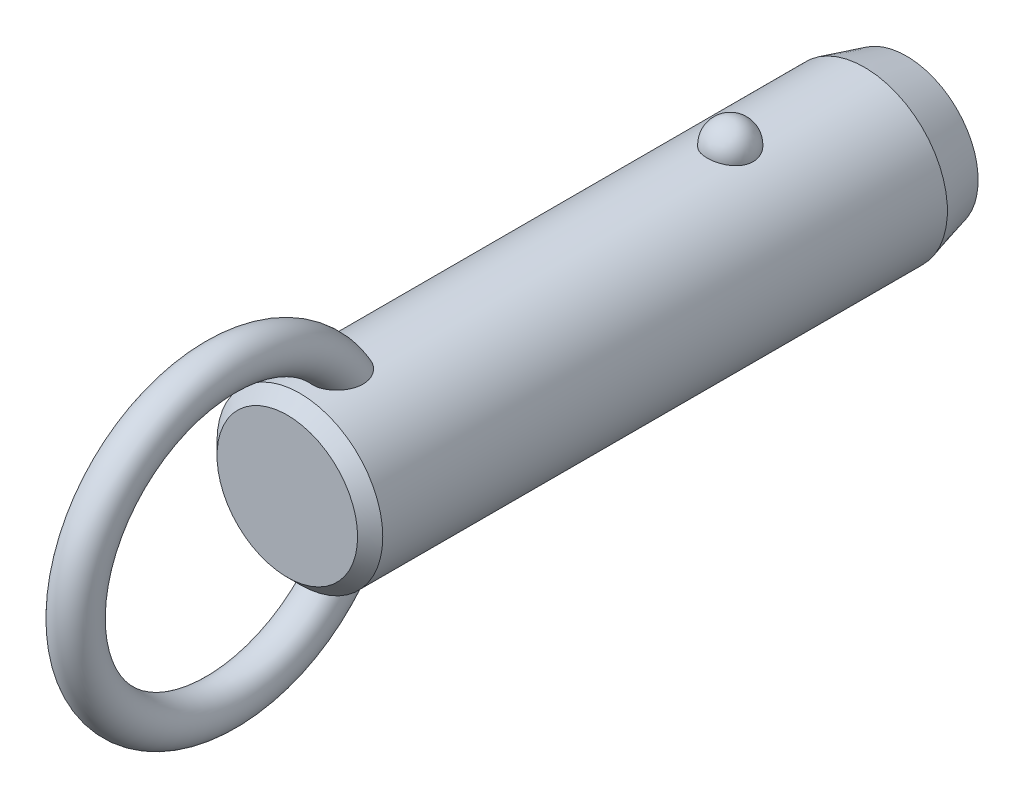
ISO-10303-21;
HEADER;
FILE_DESCRIPTION(('STEP AP214'),'2;1');
FILE_NAME('part.step','',(''),(''),'','','');
FILE_SCHEMA(('AUTOMOTIVE_DESIGN { 1 0 10303 214 1 1 1 1 }'));
ENDSEC;
DATA;
#1=APPLICATION_CONTEXT('core data for automotive mechanical design processes');
#2=APPLICATION_PROTOCOL_DEFINITION('international standard','automotive_design',2000,#1);
#3=PRODUCT_CONTEXT('',#1,'mechanical');
#4=PRODUCT('Part','Part','',(#3));
#5=PRODUCT_RELATED_PRODUCT_CATEGORY('part','',(#4));
#6=PRODUCT_DEFINITION_FORMATION('','',#4);
#7=PRODUCT_DEFINITION_CONTEXT('part definition',#1,'design');
#8=PRODUCT_DEFINITION('design','',#6,#7);
#9=PRODUCT_DEFINITION_SHAPE('','',#8);
#10=(LENGTH_UNIT() NAMED_UNIT(*) SI_UNIT(.MILLI.,.METRE.));
#11=(NAMED_UNIT(*) PLANE_ANGLE_UNIT() SI_UNIT($,.RADIAN.));
#12=(NAMED_UNIT(*) SI_UNIT($,.STERADIAN.) SOLID_ANGLE_UNIT());
#13=UNCERTAINTY_MEASURE_WITH_UNIT(LENGTH_MEASURE(1.E-05),#10,'distance_accuracy_value','');
#14=(GEOMETRIC_REPRESENTATION_CONTEXT(3) GLOBAL_UNCERTAINTY_ASSIGNED_CONTEXT((#13)) GLOBAL_UNIT_ASSIGNED_CONTEXT((#10,
#11,#12)) REPRESENTATION_CONTEXT('',''));
#15=CARTESIAN_POINT('',(0.,0.,0.));
#16=DIRECTION('',(0.,0.,1.));
#17=DIRECTION('',(1.,0.,0.));
#18=AXIS2_PLACEMENT_3D('',#15,#16,#17);
#19=CARTESIAN_POINT('',(0.,0.,30.5));
#20=DIRECTION('',(0.,0.,-1.));
#21=DIRECTION('',(-1.,0.,0.));
#22=AXIS2_PLACEMENT_3D('',#19,#20,#21);
#23=CYLINDRICAL_SURFACE('',#22,7.9);
#24=CARTESIAN_POINT('',(2.1785689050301,7.59367088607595,-2.20000000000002));
#25=CARTESIAN_POINT('',(2.17856679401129,7.59367269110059,-2.07701843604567));
#26=CARTESIAN_POINT('',(2.16853481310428,7.59657145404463,-1.95401006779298));
#27=CARTESIAN_POINT('',(2.12864689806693,7.607843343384,-1.71147811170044));
#28=CARTESIAN_POINT('',(2.09878338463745,7.61621856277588,-1.5919558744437));
#29=CARTESIAN_POINT('',(2.0199931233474,7.63749180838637,-1.35985638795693));
#30=CARTESIAN_POINT('',(1.97107475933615,7.6503878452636,-1.24727610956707));
#31=CARTESIAN_POINT('',(1.85539377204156,7.67926115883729,-1.03213234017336));
#32=CARTESIAN_POINT('',(1.78863158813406,7.69523835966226,-0.929568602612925));
#33=CARTESIAN_POINT('',(1.63856494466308,7.7285848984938,-0.736786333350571));
#34=CARTESIAN_POINT('',(1.55518140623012,7.7459606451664,-0.646630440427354));
#35=CARTESIAN_POINT('',(1.37422937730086,7.78009978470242,-0.481747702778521));
#36=CARTESIAN_POINT('',(1.27666086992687,7.79686317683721,-0.407020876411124));
#37=CARTESIAN_POINT('',(1.07024728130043,7.82786153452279,-0.275278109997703));
#38=CARTESIAN_POINT('',(0.961434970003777,7.84210353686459,-0.218212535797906));
#39=CARTESIAN_POINT('',(0.735351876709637,7.86652194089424,-0.123146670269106));
#40=CARTESIAN_POINT('',(0.618082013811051,7.87669878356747,-0.0851443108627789));
#41=CARTESIAN_POINT('',(0.380637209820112,7.89170521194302,-0.0298158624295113));
#42=CARTESIAN_POINT('',(0.260550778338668,7.89662650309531,-0.0121347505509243));
#43=CARTESIAN_POINT('',(0.019011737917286,7.90090003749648,0.00324379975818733));
#44=CARTESIAN_POINT('',(-0.10244074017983,7.90025280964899,0.000943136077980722));
#45=CARTESIAN_POINT('',(-0.341452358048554,7.89351056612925,-0.0233955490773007));
#46=CARTESIAN_POINT('',(-0.459042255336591,7.88749257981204,-0.0451545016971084));
#47=CARTESIAN_POINT('',(-0.688796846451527,7.87075812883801,-0.107408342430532));
#48=CARTESIAN_POINT('',(-0.800961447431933,7.86004158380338,-0.14790355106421));
#49=CARTESIAN_POINT('',(-1.01743634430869,7.83497131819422,-0.246799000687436));
#50=CARTESIAN_POINT('',(-1.12169791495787,7.82059709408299,-0.305300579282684));
#51=CARTESIAN_POINT('',(-1.31891765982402,7.78976470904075,-0.438549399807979));
#52=CARTESIAN_POINT('',(-1.41187469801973,7.77330633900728,-0.513298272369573));
#53=CARTESIAN_POINT('',(-1.58577142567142,7.73972434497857,-0.678622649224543));
#54=CARTESIAN_POINT('',(-1.66645140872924,7.72259402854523,-0.769470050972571));
#55=CARTESIAN_POINT('',(-1.81161503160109,7.68983776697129,-0.963538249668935));
#56=CARTESIAN_POINT('',(-1.87609753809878,7.6742119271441,-1.0667599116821));
#57=CARTESIAN_POINT('',(-1.98790138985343,7.6460202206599,-1.28401170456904));
#58=CARTESIAN_POINT('',(-2.03501994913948,7.63349104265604,-1.39815107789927));
#59=CARTESIAN_POINT('',(-2.10986724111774,7.6131449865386,-1.6330178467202));
#60=CARTESIAN_POINT('',(-2.1375965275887,7.60532797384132,-1.75374505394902));
#61=CARTESIAN_POINT('',(-2.17289256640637,7.5953195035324,-1.99782562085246));
#62=CARTESIAN_POINT('',(-2.18054294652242,7.59310471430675,-2.12116592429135));
#63=CARTESIAN_POINT('',(-2.17572919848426,7.59448538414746,-2.36741799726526));
#64=CARTESIAN_POINT('',(-2.1632656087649,7.59808068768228,-2.49032977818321));
#65=CARTESIAN_POINT('',(-2.11865035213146,7.61064035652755,-2.73161015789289));
#66=CARTESIAN_POINT('',(-2.08659579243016,7.61957823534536,-2.84999812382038));
#67=CARTESIAN_POINT('',(-2.00367799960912,7.64179982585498,-3.07955956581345));
#68=CARTESIAN_POINT('',(-1.9528140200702,7.65508371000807,-3.19073275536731));
#69=CARTESIAN_POINT('',(-1.83321113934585,7.68460381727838,-3.40337899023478));
#70=CARTESIAN_POINT('',(-1.76437735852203,7.70085556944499,-3.5047965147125));
#71=CARTESIAN_POINT('',(-1.61069526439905,7.73445734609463,-3.69446912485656));
#72=CARTESIAN_POINT('',(-1.52584634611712,7.75180741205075,-3.78272371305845));
#73=CARTESIAN_POINT('',(-1.34198059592,7.78574608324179,-3.94393987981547));
#74=CARTESIAN_POINT('',(-1.24291308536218,7.80233167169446,-4.01684434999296));
#75=CARTESIAN_POINT('',(-1.03352039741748,7.83281625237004,-4.14489386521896));
#76=CARTESIAN_POINT('',(-0.92319600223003,7.84671543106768,-4.20004014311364));
#77=CARTESIAN_POINT('',(-0.695822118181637,7.87011575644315,-4.29042017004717));
#78=CARTESIAN_POINT('',(-0.578872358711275,7.87966903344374,-4.32589112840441));
#79=CARTESIAN_POINT('',(-0.340410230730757,7.8935652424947,-4.37692226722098));
#80=CARTESIAN_POINT('',(-0.218898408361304,7.89790879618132,-4.39248482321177));
#81=CARTESIAN_POINT('',(0.0228107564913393,7.90087453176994,-4.40314405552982));
#82=CARTESIAN_POINT('',(0.142990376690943,7.89960185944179,-4.39861683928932));
#83=CARTESIAN_POINT('',(0.380829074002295,7.89171262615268,-4.37008293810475));
#84=CARTESIAN_POINT('',(0.498488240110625,7.8850962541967,-4.34607694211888));
#85=CARTESIAN_POINT('',(0.727535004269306,7.86726442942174,-4.27939317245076));
#86=CARTESIAN_POINT('',(0.838944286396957,7.85606616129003,-4.23678512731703));
#87=CARTESIAN_POINT('',(1.05295421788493,7.83025654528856,-4.13408348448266));
#88=CARTESIAN_POINT('',(1.15555431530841,7.81564498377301,-4.07398879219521));
#89=CARTESIAN_POINT('',(1.35076763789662,7.7843022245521,-3.93687432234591));
#90=CARTESIAN_POINT('',(1.4432046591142,7.76754209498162,-3.85961036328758));
#91=CARTESIAN_POINT('',(1.6139111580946,7.73387857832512,-3.69076949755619));
#92=CARTESIAN_POINT('',(1.6921781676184,7.71697516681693,-3.59919010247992));
#93=CARTESIAN_POINT('',(1.83380875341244,7.6845643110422,-3.40247278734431));
#94=CARTESIAN_POINT('',(1.89689280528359,7.66908588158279,-3.29712873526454));
#95=CARTESIAN_POINT('',(2.0047823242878,7.64159441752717,-3.07707931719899));
#96=CARTESIAN_POINT('',(2.0495945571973,7.62958010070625,-2.96237743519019));
#97=CARTESIAN_POINT('',(2.11580183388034,7.61146617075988,-2.74040519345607));
#98=CARTESIAN_POINT('',(2.13929812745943,7.60484503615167,-2.63379846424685));
#99=CARTESIAN_POINT('',(2.17068242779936,7.59594664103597,-2.4181348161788));
#100=CARTESIAN_POINT('',(2.17857077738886,7.59366928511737,-2.30907795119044));
#101=CARTESIAN_POINT('',(2.1785689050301,7.59367088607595,-2.20000000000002));
#102=B_SPLINE_CURVE_WITH_KNOTS('',3,(#24,#25,#26,#27,#28,#29,#30,#31,#32,#33,#34,#35,#36,#37,
#38,#39,#40,#41,#42,#43,#44,#45,#46,#47,#48,#49,#50,#51,#52,#53,#54,#55,#56,#57,#58,#59,#60,#61,
#62,#63,#64,#65,#66,#67,#68,#69,#70,#71,#72,#73,#74,#75,#76,#77,#78,#79,#80,#81,#82,#83,#84,#85,
#86,#87,#88,#89,#90,#91,#92,#93,#94,#95,#96,#97,#98,#99,#100,#101),.UNSPECIFIED.,.T.,.F.,(4,2,2,
2,2,2,2,2,2,2,2,2,2,2,2,2,2,2,2,2,2,2,2,2,2,2,2,2,2,2,2,2,2,2,2,2,2,2,4),(0.,0.368552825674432,
0.737246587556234,1.10577831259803,1.4743009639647,1.84462067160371,2.21494081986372,
2.5842105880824,2.95344028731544,3.31611630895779,3.67875788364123,4.03628044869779,
4.39380913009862,4.75338791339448,5.11300280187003,5.47939989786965,5.8458226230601,
6.21639834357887,6.58696347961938,6.95598276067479,7.32499216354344,7.69218715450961,
8.0593967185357,8.42858578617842,8.79778880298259,9.16834203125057,9.5388695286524,
9.90482699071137,10.2707407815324,10.6298333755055,10.9889132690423,11.3466585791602,
11.7044262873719,12.0676511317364,12.4309391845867,12.8004764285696,13.1698767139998,
13.4967701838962,13.8236564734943),.UNSPECIFIED.);
#103=CARTESIAN_POINT('',(2.1785689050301,7.59367088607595,-2.20000000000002));
#104=VERTEX_POINT('',#103);
#105=EDGE_CURVE('E41',#104,#104,#102,.T.);
#106=ORIENTED_EDGE('',*,*,#105,.T.);
#107=EDGE_LOOP('',(#106));
#108=FACE_BOUND('',#107,.T.);
#109=CARTESIAN_POINT('',(0.,0.,38.82));
#110=DIRECTION('',(0.,0.,1.));
#111=DIRECTION('',(1.,0.,0.));
#112=AXIS2_PLACEMENT_3D('',#109,#110,#111);
#113=CIRCLE('',#112,7.9);
#114=CARTESIAN_POINT('',(7.9,0.,38.82));
#115=VERTEX_POINT('',#114);
#116=EDGE_CURVE('E10',#115,#115,#113,.F.);
#117=ORIENTED_EDGE('',*,*,#116,.T.);
#118=EDGE_LOOP('',(#117));
#119=FACE_BOUND('',#118,.T.);
#120=CARTESIAN_POINT('',(-0.63096985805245,-7.87476203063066,32.7124322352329));
#121=CARTESIAN_POINT('',(-0.734180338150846,-7.86648998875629,32.747285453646));
#122=CARTESIAN_POINT('',(-0.834476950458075,-7.85639291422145,32.7908160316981));
#123=CARTESIAN_POINT('',(-1.0262035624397,-7.83366343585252,32.8940948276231));
#124=CARTESIAN_POINT('',(-1.1176141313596,-7.82102565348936,32.9538775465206));
#125=CARTESIAN_POINT('',(-1.28877277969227,-7.79464922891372,33.0878390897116));
#126=CARTESIAN_POINT('',(-1.36854014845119,-7.78091246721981,33.161993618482));
#127=CARTESIAN_POINT('',(-1.51461521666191,-7.75380398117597,33.3224941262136));
#128=CARTESIAN_POINT('',(-1.58092966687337,-7.74043207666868,33.4088339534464));
#129=CARTESIAN_POINT('',(-1.70019064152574,-7.7151252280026,33.5929784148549));
#130=CARTESIAN_POINT('',(-1.75284037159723,-7.70322473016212,33.6909792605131));
#131=CARTESIAN_POINT('',(-1.84263464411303,-7.68224112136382,33.8941029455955));
#132=CARTESIAN_POINT('',(-1.87977299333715,-7.6731591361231,33.9992286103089));
#133=CARTESIAN_POINT('',(-1.94152728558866,-7.65777930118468,34.2232849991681));
#134=CARTESIAN_POINT('',(-1.96475471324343,-7.65179654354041,34.3426167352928));
#135=CARTESIAN_POINT('',(-1.99449499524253,-7.64409642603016,34.5834298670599));
#136=CARTESIAN_POINT('',(-2.0010005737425,-7.64238092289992,34.7049121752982));
#137=CARTESIAN_POINT('',(-1.99856014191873,-7.64302120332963,34.9683409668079));
#138=CARTESIAN_POINT('',(-1.98680021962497,-7.64611845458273,35.1102565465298));
#139=CARTESIAN_POINT('',(-1.9445777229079,-7.65696186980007,35.3911188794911));
#140=CARTESIAN_POINT('',(-1.91409393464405,-7.66471330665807,35.5300620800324));
#141=CARTESIAN_POINT('',(-1.82768670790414,-7.68582947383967,35.831939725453));
#142=CARTESIAN_POINT('',(-1.76772963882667,-7.70003779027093,35.993686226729));
#143=CARTESIAN_POINT('',(-1.65998501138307,-7.72371550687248,36.2276956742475));
#144=CARTESIAN_POINT('',(-1.621079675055,-7.73200670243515,36.3042974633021));
#145=CARTESIAN_POINT('',(-1.53727726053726,-7.74910377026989,36.4540798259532));
#146=CARTESIAN_POINT('',(-1.49238215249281,-7.75790947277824,36.5272615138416));
#147=CARTESIAN_POINT('',(-1.37397050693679,-7.77993338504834,36.7028838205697));
#148=CARTESIAN_POINT('',(-1.29690364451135,-7.79328473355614,36.8029557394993));
#149=CARTESIAN_POINT('',(-1.12885487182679,-7.81939266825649,36.9907147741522));
#150=CARTESIAN_POINT('',(-1.03789926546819,-7.83215032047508,37.0784247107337));
#151=CARTESIAN_POINT('',(-0.869532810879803,-7.85231710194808,37.2134148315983));
#152=CARTESIAN_POINT('',(-0.79571640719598,-7.86021093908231,37.265076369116));
#153=CARTESIAN_POINT('',(-0.640813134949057,-7.87434920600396,37.3563815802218));
#154=CARTESIAN_POINT('',(-0.559737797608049,-7.88059619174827,37.3960438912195));
#155=CARTESIAN_POINT('',(-0.40645605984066,-7.88984116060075,37.4543008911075));
#156=CARTESIAN_POINT('',(-0.335227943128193,-7.89321892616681,37.4753848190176));
#157=CARTESIAN_POINT('',(-0.190193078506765,-7.89804235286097,37.5054141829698));
#158=CARTESIAN_POINT('',(-0.116388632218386,-7.89948969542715,37.5143701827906));
#159=CARTESIAN_POINT('',(0.0318414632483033,-7.90028409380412,37.5192915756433));
#160=CARTESIAN_POINT('',(0.10626813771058,-7.89962640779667,37.5152276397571));
#161=CARTESIAN_POINT('',(0.253290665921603,-7.8962818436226,37.4944615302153));
#162=CARTESIAN_POINT('',(0.32588518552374,-7.8935935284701,37.4777504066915));
#163=CARTESIAN_POINT('',(0.481441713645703,-7.88577340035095,37.4287380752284));
#164=CARTESIAN_POINT('',(0.563611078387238,-7.88026321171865,37.394005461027));
#165=CARTESIAN_POINT('',(0.721129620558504,-7.86741729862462,37.3117965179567));
#166=CARTESIAN_POINT('',(0.796466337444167,-7.86007832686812,37.2642975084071));
#167=CARTESIAN_POINT('',(0.971456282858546,-7.84073285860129,37.136513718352));
#168=CARTESIAN_POINT('',(1.06719686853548,-7.82809461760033,37.0510047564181));
#169=CARTESIAN_POINT('',(1.24418921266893,-7.80192439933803,36.866232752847));
#170=CARTESIAN_POINT('',(1.32540832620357,-7.78839049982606,36.7669395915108));
#171=CARTESIAN_POINT('',(1.45199971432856,-7.76559693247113,36.5895760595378));
#172=CARTESIAN_POINT('',(1.50085649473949,-7.75626094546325,36.5139542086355));
#173=CARTESIAN_POINT('',(1.59197749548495,-7.7380727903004,36.3587428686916));
#174=CARTESIAN_POINT('',(1.63423919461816,-7.72922080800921,36.2791518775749));
#175=CARTESIAN_POINT('',(1.71222612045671,-7.71231959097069,36.1166640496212));
#176=CARTESIAN_POINT('',(1.74794516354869,-7.70427111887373,36.033764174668));
#177=CARTESIAN_POINT('',(1.81270113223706,-7.68929240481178,35.8652967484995));
#178=CARTESIAN_POINT('',(1.84173789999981,-7.68236218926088,35.7797291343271));
#179=CARTESIAN_POINT('',(1.89322698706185,-7.6698375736,35.6052870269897));
#180=CARTESIAN_POINT('',(1.91558744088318,-7.66426199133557,35.5163838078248));
#181=CARTESIAN_POINT('',(1.95281367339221,-7.65485915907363,35.3369696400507));
#182=CARTESIAN_POINT('',(1.96767946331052,-7.65103190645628,35.2464586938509));
#183=CARTESIAN_POINT('',(2.0002145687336,-7.64262981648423,34.9737320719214));
#184=CARTESIAN_POINT('',(2.00600691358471,-7.6410871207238,34.7897099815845));
#185=CARTESIAN_POINT('',(1.98445334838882,-7.64669564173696,34.4765019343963));
#186=CARTESIAN_POINT('',(1.96607186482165,-7.65149688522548,34.346618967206));
#187=CARTESIAN_POINT('',(1.90884967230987,-7.66597624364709,34.0916321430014));
#188=CARTESIAN_POINT('',(1.87002101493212,-7.67565148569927,33.966525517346));
#189=CARTESIAN_POINT('',(1.77063986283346,-7.69918471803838,33.7245401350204));
#190=CARTESIAN_POINT('',(1.70993724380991,-7.71307150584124,33.6077250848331));
#191=CARTESIAN_POINT('',(1.56733070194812,-7.74330306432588,33.3881444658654));
#192=CARTESIAN_POINT('',(1.48543692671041,-7.75964665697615,33.2853722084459));
#193=CARTESIAN_POINT('',(1.31346177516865,-7.79047523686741,33.1093800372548));
#194=CARTESIAN_POINT('',(1.22547278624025,-7.80495298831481,33.0341066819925));
#195=CARTESIAN_POINT('',(1.03724352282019,-7.83218597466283,32.9004864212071));
#196=CARTESIAN_POINT('',(0.937008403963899,-7.84494192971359,32.8421324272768));
#197=CARTESIAN_POINT('',(0.73359933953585,-7.86649045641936,32.7470270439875));
#198=CARTESIAN_POINT('',(0.630941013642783,-7.87547134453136,32.7092109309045));
#199=CARTESIAN_POINT('',(0.420465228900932,-7.88950708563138,32.6511160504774));
#200=CARTESIAN_POINT('',(0.312645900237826,-7.89456050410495,32.6308436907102));
#201=CARTESIAN_POINT('',(0.0960869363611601,-7.9001518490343,32.6084559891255));
#202=CARTESIAN_POINT('',(-0.0126341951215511,-7.90073226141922,32.6061698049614));
#203=CARTESIAN_POINT('',(-0.228766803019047,-7.89742350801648,32.6193678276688));
#204=CARTESIAN_POINT('',(-0.336180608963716,-7.89354403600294,32.6348134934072));
#205=CARTESIAN_POINT('',(-0.473410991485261,-7.88586871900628,32.6662177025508));
#206=CARTESIAN_POINT('',(-0.5052577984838,-7.88388984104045,32.6743541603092));
#207=CARTESIAN_POINT('',(-0.568481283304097,-7.87958326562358,32.6922083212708));
#208=CARTESIAN_POINT('',(-0.599857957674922,-7.87725556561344,32.7019260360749));
#209=CARTESIAN_POINT('',(-0.63096985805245,-7.87476203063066,32.7124322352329));
#210=B_SPLINE_CURVE_WITH_KNOTS('',3,(#120,#121,#122,#123,#124,#125,#126,#127,#128,#129,#130,
#131,#132,#133,#134,#135,#136,#137,#138,#139,#140,#141,#142,#143,#144,#145,#146,#147,#148,#149,
#150,#151,#152,#153,#154,#155,#156,#157,#158,#159,#160,#161,#162,#163,#164,#165,#166,#167,#168,
#169,#170,#171,#172,#173,#174,#175,#176,#177,#178,#179,#180,#181,#182,#183,#184,#185,#186,#187,
#188,#189,#190,#191,#192,#193,#194,#195,#196,#197,#198,#199,#200,#201,#202,#203,#204,#205,#206,
#207,#208,#209),.UNSPECIFIED.,.T.,.F.,(4,2,2,2,2,2,2,2,2,2,2,2,2,2,2,2,2,2,2,2,2,2,2,2,2,2,2,2,
2,2,2,2,2,2,2,2,2,2,2,2,2,2,2,2,4),(0.,0.327622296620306,0.65594559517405,0.983718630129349,
1.3113267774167,1.64554655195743,1.97989964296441,2.34365728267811,2.70757317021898,
3.13333684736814,3.55958380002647,4.07655306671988,4.3352789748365,4.593919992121,
4.9738243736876,5.35301797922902,5.62348245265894,5.89352465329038,6.11565959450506,
6.33760092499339,6.56004255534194,6.78264174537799,7.04930844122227,7.31645206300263,
7.70130871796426,8.08701995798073,8.35824509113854,8.62957365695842,8.90115735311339,
9.17274746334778,9.447918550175,9.7230892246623,10.2715298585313,10.6638393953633,
11.0559179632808,11.4507403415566,11.8453740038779,12.1936425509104,12.5417649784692,
12.8695063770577,13.1973674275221,13.5221104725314,13.8461490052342,13.9449071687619,
14.0436660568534),.UNSPECIFIED.);
#211=CARTESIAN_POINT('',(-0.63096985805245,-7.87476203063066,32.7124322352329));
#212=VERTEX_POINT('',#211);
#213=EDGE_CURVE('E59',#212,#212,#210,.T.);
#214=ORIENTED_EDGE('',*,*,#213,.T.);
#215=EDGE_LOOP('',(#214));
#216=FACE_BOUND('',#215,.T.);
#217=CARTESIAN_POINT('',(-0.63096985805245,7.87476203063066,32.7124322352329));
#218=CARTESIAN_POINT('',(-0.528918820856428,7.88293636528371,32.6779798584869));
#219=CARTESIAN_POINT('',(-0.423745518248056,7.88934810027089,32.651915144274));
#220=CARTESIAN_POINT('',(-0.210236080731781,7.8979273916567,32.6172825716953));
#221=CARTESIAN_POINT('',(-0.10189380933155,7.90008607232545,32.6087513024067));
#222=CARTESIAN_POINT('',(0.11466056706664,7.89990877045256,32.6094570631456));
#223=CARTESIAN_POINT('',(0.222872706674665,7.89757640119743,32.6186798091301));
#224=CARTESIAN_POINT('',(0.436107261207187,7.88867538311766,32.6546525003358));
#225=CARTESIAN_POINT('',(0.541131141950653,7.8821087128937,32.6813942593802));
#226=CARTESIAN_POINT('',(0.745085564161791,7.86545130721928,32.7517561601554));
#227=CARTESIAN_POINT('',(0.844015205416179,7.85536005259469,32.7953787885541));
#228=CARTESIAN_POINT('',(1.03299167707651,7.83275153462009,32.8983796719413));
#229=CARTESIAN_POINT('',(1.12303841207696,7.8202342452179,32.9577580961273));
#230=CARTESIAN_POINT('',(1.29214734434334,7.79408219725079,33.0908647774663));
#231=CARTESIAN_POINT('',(1.37116907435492,7.78044359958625,33.1646436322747));
#232=CARTESIAN_POINT('',(1.51597677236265,7.75353170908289,33.3242353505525));
#233=CARTESIAN_POINT('',(1.58176261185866,7.74025841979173,33.4100483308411));
#234=CARTESIAN_POINT('',(1.70057386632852,7.71504069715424,33.593644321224));
#235=CARTESIAN_POINT('',(1.75320073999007,7.7031425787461,33.6916906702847));
#236=CARTESIAN_POINT('',(1.84293767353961,7.68216822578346,33.8948931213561));
#237=CARTESIAN_POINT('',(1.88004278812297,7.67309289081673,34.0000514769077));
#238=CARTESIAN_POINT('',(1.9417232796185,7.6577294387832,34.2241671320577));
#239=CARTESIAN_POINT('',(1.96491037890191,7.65175648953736,34.3435248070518));
#240=CARTESIAN_POINT('',(1.9945689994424,7.64407702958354,34.5843848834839));
#241=CARTESIAN_POINT('',(2.00103304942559,7.64237242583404,34.7058882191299));
#242=CARTESIAN_POINT('',(1.99850166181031,7.64303650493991,34.9693688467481));
#243=CARTESIAN_POINT('',(1.98669038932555,7.64614714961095,35.1113141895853));
#244=CARTESIAN_POINT('',(1.94436120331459,7.6570170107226,35.3922287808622));
#245=CARTESIAN_POINT('',(1.91382203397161,7.66478150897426,35.5311944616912));
#246=CARTESIAN_POINT('',(1.82728754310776,7.68592483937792,35.8331110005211));
#247=CARTESIAN_POINT('',(1.76725778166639,7.7001468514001,35.9948721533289));
#248=CARTESIAN_POINT('',(1.65939700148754,7.72384204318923,36.2288914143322));
#249=CARTESIAN_POINT('',(1.62045187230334,7.73213852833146,36.3054942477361));
#250=CARTESIAN_POINT('',(1.53656684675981,7.74924489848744,36.4552737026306));
#251=CARTESIAN_POINT('',(1.49162892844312,7.75805461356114,36.5284514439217));
#252=CARTESIAN_POINT('',(1.37317698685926,7.78007342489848,36.7039520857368));
#253=CARTESIAN_POINT('',(1.29612360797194,7.79341423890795,36.8039112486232));
#254=CARTESIAN_POINT('',(1.12812043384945,7.81949839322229,36.9914508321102));
#255=CARTESIAN_POINT('',(1.03719688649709,7.83224280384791,37.0790540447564));
#256=CARTESIAN_POINT('',(0.868871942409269,7.85239026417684,37.2138971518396));
#257=CARTESIAN_POINT('',(0.79505627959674,7.86027769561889,37.2655113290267));
#258=CARTESIAN_POINT('',(0.640160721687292,7.87440222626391,37.3567201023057));
#259=CARTESIAN_POINT('',(0.559092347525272,7.88064188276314,37.3963333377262));
#260=CARTESIAN_POINT('',(0.405820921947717,7.8898738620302,37.4545056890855));
#261=CARTESIAN_POINT('',(0.334594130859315,7.89324577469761,37.4755523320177));
#262=CARTESIAN_POINT('',(0.189568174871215,7.89805733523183,37.5055070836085));
#263=CARTESIAN_POINT('',(0.115771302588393,7.89949866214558,37.5144257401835));
#264=CARTESIAN_POINT('',(-0.0324359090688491,7.90028156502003,37.5192758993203));
#265=CARTESIAN_POINT('',(-0.106847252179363,7.89961843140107,37.5151782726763));
#266=CARTESIAN_POINT('',(-0.253834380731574,7.8962642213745,37.4943519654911));
#267=CARTESIAN_POINT('',(-0.326408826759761,7.89357170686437,37.4776143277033));
#268=CARTESIAN_POINT('',(-0.481962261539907,7.88574179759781,37.4285391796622));
#269=CARTESIAN_POINT('',(-0.564145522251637,7.88022507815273,37.3937638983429));
#270=CARTESIAN_POINT('',(-0.721685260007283,7.8673664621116,37.3114686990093));
#271=CARTESIAN_POINT('',(-0.797029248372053,7.8600213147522,37.2639260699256));
#272=CARTESIAN_POINT('',(-0.972044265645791,7.84066026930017,37.1360267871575));
#273=CARTESIAN_POINT('',(-1.06779803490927,7.82801274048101,37.0504436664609));
#274=CARTESIAN_POINT('',(-1.24480531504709,7.80182621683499,36.8655223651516));
#275=CARTESIAN_POINT('',(-1.3260261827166,7.78828530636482,36.7661540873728));
#276=CARTESIAN_POINT('',(-1.45259834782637,7.76548487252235,36.5886806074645));
#277=CARTESIAN_POINT('',(-1.50143856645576,7.75614818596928,36.5130252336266));
#278=CARTESIAN_POINT('',(-1.59252410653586,7.73796020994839,36.3577484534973));
#279=CARTESIAN_POINT('',(-1.63476690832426,7.72910910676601,36.2781255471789));
#280=CARTESIAN_POINT('',(-1.71271318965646,7.71221133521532,36.1155750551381));
#281=CARTESIAN_POINT('',(-1.74841047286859,7.70416543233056,36.0326444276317));
#282=CARTESIAN_POINT('',(-1.81311929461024,7.6891937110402,35.8641168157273));
#283=CARTESIAN_POINT('',(-1.84213067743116,7.6822679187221,35.7785197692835));
#284=CARTESIAN_POINT('',(-1.89356259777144,7.66975461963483,35.6040254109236));
#285=CARTESIAN_POINT('',(-1.91589165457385,7.66418586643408,35.5150995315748));
#286=CARTESIAN_POINT('',(-1.95305070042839,7.65479859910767,35.3356424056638));
#287=CARTESIAN_POINT('',(-1.96788069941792,7.65098008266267,35.2451111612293));
#288=CARTESIAN_POINT('',(-2.00030078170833,7.64260704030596,34.9723270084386));
#289=CARTESIAN_POINT('',(-2.00600576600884,7.64108760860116,34.7882718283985));
#290=CARTESIAN_POINT('',(-1.98428483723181,7.64673945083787,34.4750800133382));
#291=CARTESIAN_POINT('',(-1.96583698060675,7.6515575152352,34.3452400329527));
#292=CARTESIAN_POINT('',(-1.90848948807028,7.66606613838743,34.0903619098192));
#293=CARTESIAN_POINT('',(-1.86960376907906,7.67575338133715,33.965320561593));
#294=CARTESIAN_POINT('',(-1.7701342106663,7.6993013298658,33.7235009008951));
#295=CARTESIAN_POINT('',(-1.70940488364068,7.71318991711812,33.6067844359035));
#296=CARTESIAN_POINT('',(-1.56672953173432,7.74342495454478,33.3873404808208));
#297=CARTESIAN_POINT('',(-1.48478316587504,7.75977144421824,33.2846132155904));
#298=CARTESIAN_POINT('',(-1.31266325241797,7.79061163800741,33.108643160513));
#299=CARTESIAN_POINT('',(-1.22456383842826,7.80509908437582,33.0333589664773));
#300=CARTESIAN_POINT('',(-1.03622400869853,7.83231881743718,32.8998659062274));
#301=CARTESIAN_POINT('',(-0.936015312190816,7.84505551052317,32.8416137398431));
#302=CARTESIAN_POINT('',(-0.798824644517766,7.85957802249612,32.7775408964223));
#303=CARTESIAN_POINT('',(-0.765787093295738,7.86286821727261,32.7632248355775));
#304=CARTESIAN_POINT('',(-0.69893958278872,7.86909211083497,32.736436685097));
#305=CARTESIAN_POINT('',(-0.665129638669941,7.8720258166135,32.7239645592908));
#306=CARTESIAN_POINT('',(-0.63096985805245,7.87476203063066,32.7124322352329));
#307=B_SPLINE_CURVE_WITH_KNOTS('',3,(#217,#218,#219,#220,#221,#222,#223,#224,#225,#226,#227,
#228,#229,#230,#231,#232,#233,#234,#235,#236,#237,#238,#239,#240,#241,#242,#243,#244,#245,#246,
#247,#248,#249,#250,#251,#252,#253,#254,#255,#256,#257,#258,#259,#260,#261,#262,#263,#264,#265,
#266,#267,#268,#269,#270,#271,#272,#273,#274,#275,#276,#277,#278,#279,#280,#281,#282,#283,#284,
#285,#286,#287,#288,#289,#290,#291,#292,#293,#294,#295,#296,#297,#298,#299,#300,#301,#302,#303,
#304,#305,#306),.UNSPECIFIED.,.T.,.F.,(4,2,2,2,2,2,2,2,2,2,2,2,2,2,2,2,2,2,2,2,2,2,2,2,2,2,2,2,
2,2,2,2,2,2,2,2,2,2,2,2,2,2,2,2,4),(0.,0.323920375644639,0.648516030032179,0.972850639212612,
1.29703380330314,1.62126473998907,1.94549915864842,2.27089401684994,2.5962920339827,
2.93059633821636,3.26500707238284,3.6288164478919,3.99278833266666,4.41865421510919,
4.84500434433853,5.36209210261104,5.62087589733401,5.87957448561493,6.25918598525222,
6.63808782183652,6.90846748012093,7.17842501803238,7.40052350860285,7.62242871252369,
7.84483086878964,8.0673907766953,8.33414615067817,8.60137921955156,8.98641454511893,
9.3723041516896,9.64358673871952,9.91497268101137,10.1866142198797,10.4582620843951,
10.7334745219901,11.0086865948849,11.5572126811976,11.9494246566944,12.3413699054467,
12.7359755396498,13.1305875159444,13.4791770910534,13.82687259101,13.9353013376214,
14.0437279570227),.UNSPECIFIED.);
#308=CARTESIAN_POINT('',(-0.63096985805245,7.87476203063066,32.7124322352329));
#309=VERTEX_POINT('',#308);
#310=EDGE_CURVE('E67',#309,#309,#307,.T.);
#311=ORIENTED_EDGE('',*,*,#310,.T.);
#312=EDGE_LOOP('',(#311));
#313=FACE_BOUND('',#312,.T.);
#314=CARTESIAN_POINT('',(0.,0.,-15.));
#315=DIRECTION('',(0.,0.,-1.));
#316=DIRECTION('',(-1.,0.,0.));
#317=AXIS2_PLACEMENT_3D('',#314,#315,#316);
#318=CIRCLE('',#317,7.9);
#319=CARTESIAN_POINT('',(-7.9,0.,-15.));
#320=VERTEX_POINT('',#319);
#321=EDGE_CURVE('E56',#320,#320,#318,.F.);
#322=ORIENTED_EDGE('',*,*,#321,.T.);
#323=EDGE_LOOP('',(#322));
#324=FACE_BOUND('',#323,.T.);
#325=ADVANCED_FACE('F37',(#108,#119,#216,#313,#324),#23,.T.);
#326=CARTESIAN_POINT('',(0.,0.,-19.));
#327=DIRECTION('',(0.,0.,-1.));
#328=DIRECTION('',(-1.,0.,0.));
#329=AXIS2_PLACEMENT_3D('',#326,#327,#328);
#330=PLANE('',#329);
#331=CARTESIAN_POINT('',(0.,0.,-19.));
#332=DIRECTION('',(0.,0.,-1.));
#333=DIRECTION('',(-1.,0.,0.));
#334=AXIS2_PLACEMENT_3D('',#331,#332,#333);
#335=CIRCLE('',#334,6.82820323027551);
#336=CARTESIAN_POINT('',(-6.82820323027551,0.,-19.));
#337=VERTEX_POINT('',#336);
#338=EDGE_CURVE('E66',#337,#337,#335,.T.);
#339=ORIENTED_EDGE('',*,*,#338,.T.);
#340=EDGE_LOOP('',(#339));
#341=FACE_BOUND('',#340,.T.);
#342=ADVANCED_FACE('F85',(#341),#330,.T.);
#343=CARTESIAN_POINT('',(0.,0.,-19.));
#344=DIRECTION('',(0.,0.,1.));
#345=DIRECTION('',(1.,0.,0.));
#346=AXIS2_PLACEMENT_3D('',#343,#344,#345);
#347=CONICAL_SURFACE('',#346,6.82820323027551,0.261799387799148);
#348=ORIENTED_EDGE('',*,*,#321,.F.);
#349=EDGE_LOOP('',(#348));
#350=FACE_BOUND('',#349,.T.);
#351=ORIENTED_EDGE('',*,*,#338,.F.);
#352=EDGE_LOOP('',(#351));
#353=FACE_BOUND('',#352,.T.);
#354=ADVANCED_FACE('F83',(#350,#353),#347,.T.);
#355=CARTESIAN_POINT('',(0.,0.,40.02));
#356=DIRECTION('',(0.,0.,1.));
#357=DIRECTION('',(1.,0.,0.));
#358=AXIS2_PLACEMENT_3D('',#355,#356,#357);
#359=PLANE('',#358);
#360=CARTESIAN_POINT('',(0.,0.,40.02));
#361=DIRECTION('',(0.,0.,1.));
#362=DIRECTION('',(1.,0.,0.));
#363=AXIS2_PLACEMENT_3D('',#360,#361,#362);
#364=CIRCLE('',#363,6.70000000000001);
#365=CARTESIAN_POINT('',(6.70000000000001,0.,40.02));
#366=VERTEX_POINT('',#365);
#367=EDGE_CURVE('E50',#366,#366,#364,.T.);
#368=ORIENTED_EDGE('',*,*,#367,.T.);
#369=EDGE_LOOP('',(#368));
#370=FACE_BOUND('',#369,.T.);
#371=ADVANCED_FACE('F77',(#370),#359,.T.);
#372=CARTESIAN_POINT('',(0.,0.,46.35));
#373=DIRECTION('',(1.,0.,0.));
#374=DIRECTION('',(0.,0.,-1.));
#375=AXIS2_PLACEMENT_3D('',#372,#373,#374);
#376=TOROIDAL_SURFACE('',#375,13.85,2.);
#377=ORIENTED_EDGE('',*,*,#310,.F.);
#378=EDGE_LOOP('',(#377));
#379=FACE_BOUND('',#378,.T.);
#380=ORIENTED_EDGE('',*,*,#213,.F.);
#381=EDGE_LOOP('',(#380));
#382=FACE_BOUND('',#381,.T.);
#383=ADVANCED_FACE('F73',(#379,#382),#376,.T.);
#384=CARTESIAN_POINT('',(0.,0.,40.02));
#385=DIRECTION('',(0.,0.,-1.));
#386=DIRECTION('',(-1.,0.,0.));
#387=AXIS2_PLACEMENT_3D('',#384,#385,#386);
#388=CONICAL_SURFACE('',#387,6.70000000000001,0.785398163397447);
#389=ORIENTED_EDGE('',*,*,#116,.F.);
#390=EDGE_LOOP('',(#389));
#391=FACE_BOUND('',#390,.T.);
#392=ORIENTED_EDGE('',*,*,#367,.F.);
#393=EDGE_LOOP('',(#392));
#394=FACE_BOUND('',#393,.T.);
#395=ADVANCED_FACE('F39',(#391,#394),#388,.T.);
#396=CARTESIAN_POINT('',(0.,7.9,-2.20000000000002));
#397=DIRECTION('',(0.,1.,0.));
#398=DIRECTION('',(0.,0.,1.));
#399=AXIS2_PLACEMENT_3D('',#396,#397,#398);
#400=SPHERICAL_SURFACE('',#399,2.2);
#401=ORIENTED_EDGE('',*,*,#105,.F.);
#402=EDGE_LOOP('',(#401));
#403=FACE_BOUND('',#402,.T.);
#404=ADVANCED_FACE('F79',(#403),#400,.T.);
#405=CLOSED_SHELL('',(#325,#342,#354,#371,#383,#395,#404));
#406=MANIFOLD_SOLID_BREP('B2',#405);
#407=ADVANCED_BREP_SHAPE_REPRESENTATION('',(#18,#406),#14);
#408=SHAPE_DEFINITION_REPRESENTATION(#9,#407);
ENDSEC;
END-ISO-10303-21;
